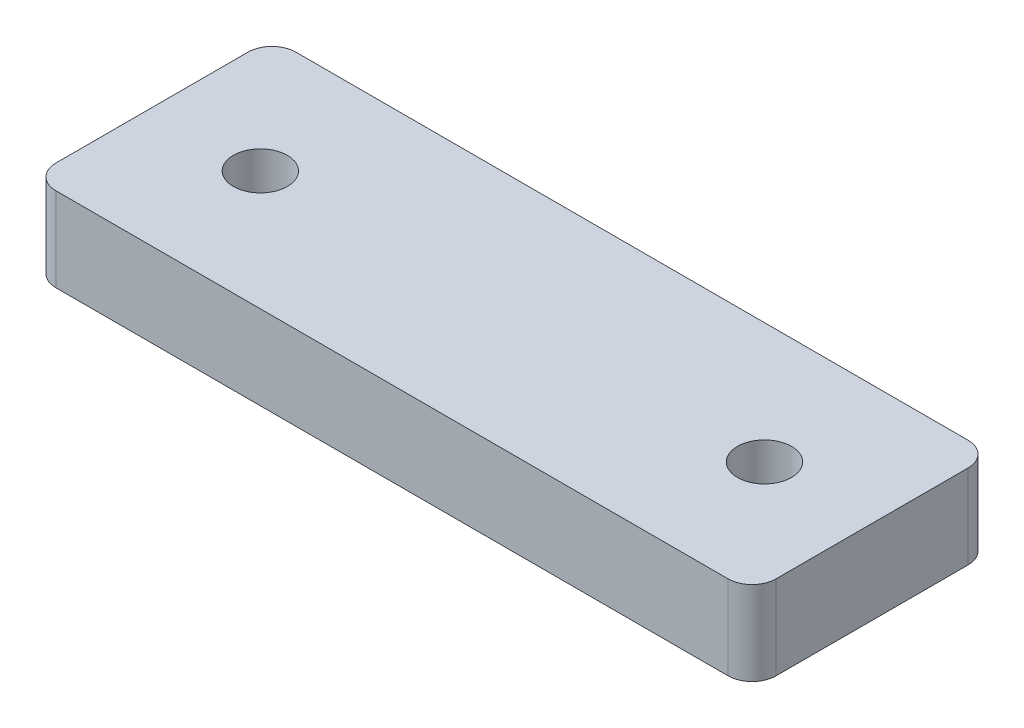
from build123d import *

# Parameters (mm, degrees)
CROQUIS1_W              = 60
CROQUIS1_H              = 7
SALIENTE_EXTRUIR1_DEPTH = 20
REDONDEO1_R             = 2
CROQUIS2_R              = 2.25
CORTAR_EXTRUIR1_DEPTH   = 20


with BuildPart() as part:
    # Croquis1 → Saliente-Extruir1 (new body)
    with BuildSketch(Plane.XY):
        with Locations((-601.605409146, 49.698592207)):
            Rectangle(CROQUIS1_W, CROQUIS1_H)
    extrude(amount=SALIENTE_EXTRUIR1_DEPTH)

    # Redondeo1
    redondeo1_edges = [part.edges().sort_by_distance(p)[0] for p in [
        (-571.605409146, 49.698592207, 20),
        (-631.605409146, 49.698592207, 20),
        (-571.605409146, 49.698592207, 0),
        (-631.605409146, 49.698592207, 0),
    ]]
    fillet(redondeo1_edges, radius=REDONDEO1_R)

    # Croquis2 → Cortar-Extruir1 (cut)
    with BuildSketch(Plane(origin=(0, 53.198592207, 0), x_dir=(1, 0, 0), z_dir=(0, 1, 0))):
        with Locations(Location((-580.521961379, -10.05, 0), (0, 0, 270))):
            Circle(CROQUIS2_R)
        with Locations(Location((-622.521961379, -10.05, 0), (0, 0, 270))):
            Circle(CROQUIS2_R)
    extrude(amount=-CORTAR_EXTRUIR1_DEPTH, mode=Mode.SUBTRACT)


solid = part.part
